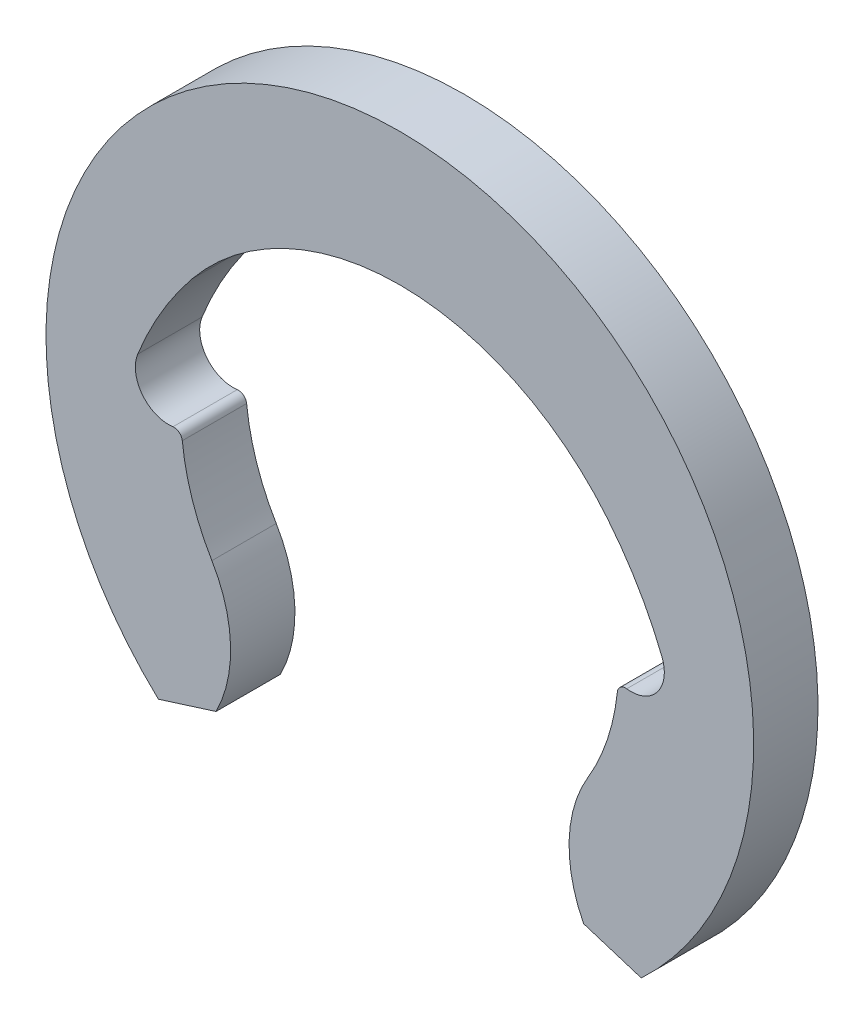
ISO-10303-21;
HEADER;
FILE_DESCRIPTION(('STEP AP214'),'2;1');
FILE_NAME('part.step','',(''),(''),'','','');
FILE_SCHEMA(('AUTOMOTIVE_DESIGN { 1 0 10303 214 1 1 1 1 }'));
ENDSEC;
DATA;
#1=APPLICATION_CONTEXT('core data for automotive mechanical design processes');
#2=APPLICATION_PROTOCOL_DEFINITION('international standard','automotive_design',2000,#1);
#3=PRODUCT_CONTEXT('',#1,'mechanical');
#4=PRODUCT('Part','Part','',(#3));
#5=PRODUCT_RELATED_PRODUCT_CATEGORY('part','',(#4));
#6=PRODUCT_DEFINITION_FORMATION('','',#4);
#7=PRODUCT_DEFINITION_CONTEXT('part definition',#1,'design');
#8=PRODUCT_DEFINITION('design','',#6,#7);
#9=PRODUCT_DEFINITION_SHAPE('','',#8);
#10=(LENGTH_UNIT() NAMED_UNIT(*) SI_UNIT(.MILLI.,.METRE.));
#11=(NAMED_UNIT(*) PLANE_ANGLE_UNIT() SI_UNIT($,.RADIAN.));
#12=(NAMED_UNIT(*) SI_UNIT($,.STERADIAN.) SOLID_ANGLE_UNIT());
#13=UNCERTAINTY_MEASURE_WITH_UNIT(LENGTH_MEASURE(1.E-05),#10,'distance_accuracy_value','');
#14=(GEOMETRIC_REPRESENTATION_CONTEXT(3) GLOBAL_UNCERTAINTY_ASSIGNED_CONTEXT((#13)) GLOBAL_UNIT_ASSIGNED_CONTEXT((#10,
#11,#12)) REPRESENTATION_CONTEXT('',''));
#15=CARTESIAN_POINT('',(0.,0.,0.));
#16=DIRECTION('',(0.,0.,1.));
#17=DIRECTION('',(1.,0.,0.));
#18=AXIS2_PLACEMENT_3D('',#15,#16,#17);
#19=CARTESIAN_POINT('',(-1.33726622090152,-0.140363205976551,0.1905));
#20=DIRECTION('',(0.,0.,-1.));
#21=DIRECTION('',(-1.,0.,0.));
#22=AXIS2_PLACEMENT_3D('',#19,#20,#21);
#23=CYLINDRICAL_SURFACE('',#22,0.0492125);
#24=CARTESIAN_POINT('',(-1.33726622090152,-0.140363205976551,-0.1905));
#25=DIRECTION('',(0.,0.,1.));
#26=DIRECTION('',(1.,0.,0.));
#27=AXIS2_PLACEMENT_3D('',#24,#25,#26);
#28=CIRCLE('',#27,0.0492125);
#29=CARTESIAN_POINT('',(-1.28832259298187,-0.135225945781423,-0.1905));
#30=VERTEX_POINT('',#29);
#31=CARTESIAN_POINT('',(-1.34373454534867,-0.0915776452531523,-0.1905));
#32=VERTEX_POINT('',#31);
#33=EDGE_CURVE('E165',#30,#32,#28,.T.);
#34=ORIENTED_EDGE('',*,*,#33,.T.);
#35=DIRECTION('',(0.,0.,-1.));
#36=VECTOR('',#35,1.);
#37=CARTESIAN_POINT('',(-1.34373454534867,-0.0915776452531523,0.1905));
#38=LINE('',#37,#36);
#39=CARTESIAN_POINT('',(-1.34373454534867,-0.0915776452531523,0.1905));
#40=VERTEX_POINT('',#39);
#41=EDGE_CURVE('E11',#40,#32,#38,.T.);
#42=ORIENTED_EDGE('',*,*,#41,.F.);
#43=CARTESIAN_POINT('',(-1.33726622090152,-0.140363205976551,0.1905));
#44=DIRECTION('',(0.,0.,1.));
#45=DIRECTION('',(1.,0.,0.));
#46=AXIS2_PLACEMENT_3D('',#43,#44,#45);
#47=CIRCLE('',#46,0.0492125);
#48=CARTESIAN_POINT('',(-1.28832259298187,-0.135225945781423,0.1905));
#49=VERTEX_POINT('',#48);
#50=EDGE_CURVE('E191',#49,#40,#47,.T.);
#51=ORIENTED_EDGE('',*,*,#50,.F.);
#52=DIRECTION('',(0.,0.,-1.));
#53=VECTOR('',#52,1.);
#54=CARTESIAN_POINT('',(-1.28832259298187,-0.135225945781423,0.1905));
#55=LINE('',#54,#53);
#56=EDGE_CURVE('E161',#49,#30,#55,.T.);
#57=ORIENTED_EDGE('',*,*,#56,.T.);
#58=EDGE_LOOP('',(#34,#42,#51,#57));
#59=FACE_BOUND('',#58,.T.);
#60=ADVANCED_FACE('F33',(#59),#23,.T.);
#61=CARTESIAN_POINT('',(-1.36960784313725,0.103564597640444,0.1905));
#62=DIRECTION('',(0.,0.,-1.));
#63=DIRECTION('',(-1.,0.,0.));
#64=AXIS2_PLACEMENT_3D('',#61,#62,#63);
#65=CYLINDRICAL_SURFACE('',#64,0.19685);
#66=CARTESIAN_POINT('',(-1.36960784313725,0.103564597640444,-0.1905));
#67=DIRECTION('',(0.,0.,-1.));
#68=DIRECTION('',(1.,0.,0.));
#69=AXIS2_PLACEMENT_3D('',#66,#67,#68);
#70=CIRCLE('',#69,0.19685);
#71=CARTESIAN_POINT('',(-1.55242571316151,0.17655465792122,-0.1905));
#72=VERTEX_POINT('',#71);
#73=EDGE_CURVE('E168',#32,#72,#70,.T.);
#74=ORIENTED_EDGE('',*,*,#73,.T.);
#75=DIRECTION('',(0.,0.,-1.));
#76=VECTOR('',#75,1.);
#77=CARTESIAN_POINT('',(-1.55242571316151,0.17655465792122,0.1905));
#78=LINE('',#77,#76);
#79=CARTESIAN_POINT('',(-1.55242571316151,0.17655465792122,0.1905));
#80=VERTEX_POINT('',#79);
#81=EDGE_CURVE('E41',#80,#72,#78,.T.);
#82=ORIENTED_EDGE('',*,*,#81,.F.);
#83=CARTESIAN_POINT('',(-1.36960784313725,0.103564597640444,0.1905));
#84=DIRECTION('',(0.,0.,-1.));
#85=DIRECTION('',(1.,0.,0.));
#86=AXIS2_PLACEMENT_3D('',#83,#84,#85);
#87=CIRCLE('',#86,0.19685);
#88=EDGE_CURVE('E110',#40,#80,#87,.T.);
#89=ORIENTED_EDGE('',*,*,#88,.F.);
#90=ORIENTED_EDGE('',*,*,#41,.T.);
#91=EDGE_LOOP('',(#74,#82,#89,#90));
#92=FACE_BOUND('',#91,.T.);
#93=ADVANCED_FACE('F279',(#92),#65,.F.);
#94=CARTESIAN_POINT('',(0.393700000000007,-0.600436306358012,0.1905));
#95=DIRECTION('',(0.,0.,-1.));
#96=DIRECTION('',(-1.,0.,0.));
#97=AXIS2_PLACEMENT_3D('',#94,#95,#96);
#98=CYLINDRICAL_SURFACE('',#97,2.0955);
#99=CARTESIAN_POINT('',(0.393700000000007,-0.600436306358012,-0.1905));
#100=DIRECTION('',(0.,0.,-1.));
#101=DIRECTION('',(-1.,0.,0.));
#102=AXIS2_PLACEMENT_3D('',#99,#100,#101);
#103=CIRCLE('',#102,2.0955);
#104=CARTESIAN_POINT('',(-1.23031250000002,0.723838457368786,-0.1905));
#105=VERTEX_POINT('',#104);
#106=EDGE_CURVE('E170',#72,#105,#103,.T.);
#107=ORIENTED_EDGE('',*,*,#106,.T.);
#108=DIRECTION('',(0.,0.,-1.));
#109=VECTOR('',#108,1.);
#110=CARTESIAN_POINT('',(-1.23031250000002,0.723838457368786,0.1905));
#111=LINE('',#110,#109);
#112=CARTESIAN_POINT('',(-1.23031250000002,0.723838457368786,0.1905));
#113=VERTEX_POINT('',#112);
#114=EDGE_CURVE('E216',#113,#105,#111,.T.);
#115=ORIENTED_EDGE('',*,*,#114,.F.);
#116=CARTESIAN_POINT('',(0.393700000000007,-0.600436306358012,0.1905));
#117=DIRECTION('',(0.,0.,-1.));
#118=DIRECTION('',(-1.,0.,0.));
#119=AXIS2_PLACEMENT_3D('',#116,#117,#118);
#120=CIRCLE('',#119,2.0955);
#121=EDGE_CURVE('E224',#80,#113,#120,.T.);
#122=ORIENTED_EDGE('',*,*,#121,.F.);
#123=ORIENTED_EDGE('',*,*,#81,.T.);
#124=EDGE_LOOP('',(#107,#115,#122,#123));
#125=FACE_BOUND('',#124,.T.);
#126=ADVANCED_FACE('F222',(#125),#98,.F.);
#127=CARTESIAN_POINT('',(0.,-0.2794,0.1905));
#128=DIRECTION('',(0.,0.,-1.));
#129=DIRECTION('',(-1.,0.,0.));
#130=AXIS2_PLACEMENT_3D('',#127,#128,#129);
#131=CYLINDRICAL_SURFACE('',#130,1.5875);
#132=CARTESIAN_POINT('',(0.,-0.2794,-0.1905));
#133=DIRECTION('',(0.,0.,-1.));
#134=DIRECTION('',(1.,0.,0.));
#135=AXIS2_PLACEMENT_3D('',#132,#133,#134);
#136=CIRCLE('',#135,1.5875);
#137=CARTESIAN_POINT('',(1.23031250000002,0.723838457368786,-0.1905));
#138=VERTEX_POINT('',#137);
#139=EDGE_CURVE('E172',#105,#138,#136,.T.);
#140=ORIENTED_EDGE('',*,*,#139,.T.);
#141=DIRECTION('',(0.,0.,-1.));
#142=VECTOR('',#141,1.);
#143=CARTESIAN_POINT('',(1.23031250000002,0.723838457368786,0.1905));
#144=LINE('',#143,#142);
#145=CARTESIAN_POINT('',(1.23031250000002,0.723838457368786,0.1905));
#146=VERTEX_POINT('',#145);
#147=EDGE_CURVE('E213',#146,#138,#144,.T.);
#148=ORIENTED_EDGE('',*,*,#147,.F.);
#149=CARTESIAN_POINT('',(0.,-0.2794,0.1905));
#150=DIRECTION('',(0.,0.,-1.));
#151=DIRECTION('',(1.,0.,0.));
#152=AXIS2_PLACEMENT_3D('',#149,#150,#151);
#153=CIRCLE('',#152,1.5875);
#154=EDGE_CURVE('E242',#113,#146,#153,.T.);
#155=ORIENTED_EDGE('',*,*,#154,.F.);
#156=ORIENTED_EDGE('',*,*,#114,.T.);
#157=EDGE_LOOP('',(#140,#148,#155,#156));
#158=FACE_BOUND('',#157,.T.);
#159=ADVANCED_FACE('F233',(#158),#131,.F.);
#160=CARTESIAN_POINT('',(-0.393699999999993,-0.600436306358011,0.1905));
#161=DIRECTION('',(0.,0.,-1.));
#162=DIRECTION('',(-1.,0.,0.));
#163=AXIS2_PLACEMENT_3D('',#160,#161,#162);
#164=CYLINDRICAL_SURFACE('',#163,2.09549999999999);
#165=CARTESIAN_POINT('',(-0.393699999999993,-0.600436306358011,-0.1905));
#166=DIRECTION('',(0.,0.,-1.));
#167=DIRECTION('',(1.,0.,0.));
#168=AXIS2_PLACEMENT_3D('',#165,#166,#167);
#169=CIRCLE('',#168,2.09549999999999);
#170=CARTESIAN_POINT('',(1.55242571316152,0.176554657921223,-0.1905));
#171=VERTEX_POINT('',#170);
#172=EDGE_CURVE('E174',#138,#171,#169,.T.);
#173=ORIENTED_EDGE('',*,*,#172,.T.);
#174=DIRECTION('',(0.,0.,-1.));
#175=VECTOR('',#174,1.);
#176=CARTESIAN_POINT('',(1.55242571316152,0.176554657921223,0.1905));
#177=LINE('',#176,#175);
#178=CARTESIAN_POINT('',(1.55242571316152,0.176554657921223,0.1905));
#179=VERTEX_POINT('',#178);
#180=EDGE_CURVE('E210',#179,#171,#177,.T.);
#181=ORIENTED_EDGE('',*,*,#180,.F.);
#182=CARTESIAN_POINT('',(-0.393699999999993,-0.600436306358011,0.1905));
#183=DIRECTION('',(0.,0.,-1.));
#184=DIRECTION('',(1.,0.,0.));
#185=AXIS2_PLACEMENT_3D('',#182,#183,#184);
#186=CIRCLE('',#185,2.09549999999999);
#187=EDGE_CURVE('E239',#146,#179,#186,.T.);
#188=ORIENTED_EDGE('',*,*,#187,.F.);
#189=ORIENTED_EDGE('',*,*,#147,.T.);
#190=EDGE_LOOP('',(#173,#181,#188,#189));
#191=FACE_BOUND('',#190,.T.);
#192=ADVANCED_FACE('F237',(#191),#164,.F.);
#193=CARTESIAN_POINT('',(1.36960784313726,0.103564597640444,0.1905));
#194=DIRECTION('',(0.,0.,-1.));
#195=DIRECTION('',(-1.,0.,0.));
#196=AXIS2_PLACEMENT_3D('',#193,#194,#195);
#197=CYLINDRICAL_SURFACE('',#196,0.196849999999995);
#198=CARTESIAN_POINT('',(1.36960784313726,0.103564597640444,-0.1905));
#199=DIRECTION('',(0.,0.,-1.));
#200=DIRECTION('',(-1.,0.,0.));
#201=AXIS2_PLACEMENT_3D('',#198,#199,#200);
#202=CIRCLE('',#201,0.196849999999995);
#203=CARTESIAN_POINT('',(1.34373454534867,-0.0915776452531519,-0.1905));
#204=VERTEX_POINT('',#203);
#205=EDGE_CURVE('E176',#171,#204,#202,.T.);
#206=ORIENTED_EDGE('',*,*,#205,.T.);
#207=DIRECTION('',(0.,0.,-1.));
#208=VECTOR('',#207,1.);
#209=CARTESIAN_POINT('',(1.34373454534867,-0.0915776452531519,0.1905));
#210=LINE('',#209,#208);
#211=CARTESIAN_POINT('',(1.34373454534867,-0.0915776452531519,0.1905));
#212=VERTEX_POINT('',#211);
#213=EDGE_CURVE('E207',#212,#204,#210,.T.);
#214=ORIENTED_EDGE('',*,*,#213,.F.);
#215=CARTESIAN_POINT('',(1.36960784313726,0.103564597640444,0.1905));
#216=DIRECTION('',(0.,0.,-1.));
#217=DIRECTION('',(-1.,0.,0.));
#218=AXIS2_PLACEMENT_3D('',#215,#216,#217);
#219=CIRCLE('',#218,0.196849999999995);
#220=EDGE_CURVE('E241',#179,#212,#219,.T.);
#221=ORIENTED_EDGE('',*,*,#220,.F.);
#222=ORIENTED_EDGE('',*,*,#180,.T.);
#223=EDGE_LOOP('',(#206,#214,#221,#222));
#224=FACE_BOUND('',#223,.T.);
#225=ADVANCED_FACE('F292',(#224),#197,.F.);
#226=CARTESIAN_POINT('',(1.33726622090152,-0.140363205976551,0.1905));
#227=DIRECTION('',(0.,0.,-1.));
#228=DIRECTION('',(-1.,0.,0.));
#229=AXIS2_PLACEMENT_3D('',#226,#227,#228);
#230=CYLINDRICAL_SURFACE('',#229,0.0492125);
#231=CARTESIAN_POINT('',(1.33726622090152,-0.140363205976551,-0.1905));
#232=DIRECTION('',(0.,0.,1.));
#233=DIRECTION('',(-1.,0.,0.));
#234=AXIS2_PLACEMENT_3D('',#231,#232,#233);
#235=CIRCLE('',#234,0.0492125);
#236=CARTESIAN_POINT('',(1.28832259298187,-0.135225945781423,-0.1905));
#237=VERTEX_POINT('',#236);
#238=EDGE_CURVE('E178',#204,#237,#235,.T.);
#239=ORIENTED_EDGE('',*,*,#238,.T.);
#240=DIRECTION('',(0.,0.,-1.));
#241=VECTOR('',#240,1.);
#242=CARTESIAN_POINT('',(1.28832259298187,-0.135225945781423,0.1905));
#243=LINE('',#242,#241);
#244=CARTESIAN_POINT('',(1.28832259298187,-0.135225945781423,0.1905));
#245=VERTEX_POINT('',#244);
#246=EDGE_CURVE('E204',#245,#237,#243,.T.);
#247=ORIENTED_EDGE('',*,*,#246,.F.);
#248=CARTESIAN_POINT('',(1.33726622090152,-0.140363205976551,0.1905));
#249=DIRECTION('',(0.,0.,1.));
#250=DIRECTION('',(-1.,0.,0.));
#251=AXIS2_PLACEMENT_3D('',#248,#249,#250);
#252=CIRCLE('',#251,0.0492125);
#253=EDGE_CURVE('E244',#212,#245,#252,.T.);
#254=ORIENTED_EDGE('',*,*,#253,.F.);
#255=ORIENTED_EDGE('',*,*,#213,.T.);
#256=EDGE_LOOP('',(#239,#247,#254,#255));
#257=FACE_BOUND('',#256,.T.);
#258=ADVANCED_FACE('F295',(#257),#230,.T.);
#259=CARTESIAN_POINT('',(0.,0.,0.1905));
#260=DIRECTION('',(0.,0.,-1.));
#261=DIRECTION('',(-1.,0.,0.));
#262=AXIS2_PLACEMENT_3D('',#259,#260,#261);
#263=CYLINDRICAL_SURFACE('',#262,1.2954);
#264=CARTESIAN_POINT('',(0.,0.,-0.1905));
#265=DIRECTION('',(0.,0.,-1.));
#266=DIRECTION('',(1.,0.,0.));
#267=AXIS2_PLACEMENT_3D('',#264,#265,#266);
#268=CIRCLE('',#267,1.2954);
#269=CARTESIAN_POINT('',(1.11300997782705,-0.662774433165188,-0.1905));
#270=VERTEX_POINT('',#269);
#271=EDGE_CURVE('E180',#237,#270,#268,.T.);
#272=ORIENTED_EDGE('',*,*,#271,.T.);
#273=DIRECTION('',(0.,0.,-1.));
#274=VECTOR('',#273,1.);
#275=CARTESIAN_POINT('',(1.11300997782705,-0.662774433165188,0.1905));
#276=LINE('',#275,#274);
#277=CARTESIAN_POINT('',(1.11300997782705,-0.662774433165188,0.1905));
#278=VERTEX_POINT('',#277);
#279=EDGE_CURVE('E201',#278,#270,#276,.T.);
#280=ORIENTED_EDGE('',*,*,#279,.F.);
#281=CARTESIAN_POINT('',(0.,0.,0.1905));
#282=DIRECTION('',(0.,0.,-1.));
#283=DIRECTION('',(1.,0.,0.));
#284=AXIS2_PLACEMENT_3D('',#281,#282,#283);
#285=CIRCLE('',#284,1.2954);
#286=EDGE_CURVE('E250',#245,#278,#285,.T.);
#287=ORIENTED_EDGE('',*,*,#286,.F.);
#288=ORIENTED_EDGE('',*,*,#246,.T.);
#289=EDGE_LOOP('',(#272,#280,#287,#288));
#290=FACE_BOUND('',#289,.T.);
#291=ADVANCED_FACE('F299',(#290),#263,.F.);
#292=CARTESIAN_POINT('',(1.78954545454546,-1.06563732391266,0.1905));
#293=DIRECTION('',(0.,0.,-1.));
#294=DIRECTION('',(-1.,0.,0.));
#295=AXIS2_PLACEMENT_3D('',#292,#293,#294);
#296=CYLINDRICAL_SURFACE('',#295,0.787400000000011);
#297=CARTESIAN_POINT('',(1.78954545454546,-1.06563732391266,-0.1905));
#298=DIRECTION('',(0.,0.,1.));
#299=DIRECTION('',(1.,0.,0.));
#300=AXIS2_PLACEMENT_3D('',#297,#298,#299);
#301=CIRCLE('',#300,0.787400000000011);
#302=CARTESIAN_POINT('',(1.08853607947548,-1.42422429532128,-0.1905));
#303=VERTEX_POINT('',#302);
#304=EDGE_CURVE('E182',#270,#303,#301,.T.);
#305=ORIENTED_EDGE('',*,*,#304,.T.);
#306=DIRECTION('',(0.,0.,-1.));
#307=VECTOR('',#306,1.);
#308=CARTESIAN_POINT('',(1.08853607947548,-1.42422429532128,0.1905));
#309=LINE('',#308,#307);
#310=CARTESIAN_POINT('',(1.08853607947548,-1.42422429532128,0.1905));
#311=VERTEX_POINT('',#310);
#312=EDGE_CURVE('E198',#311,#303,#309,.T.);
#313=ORIENTED_EDGE('',*,*,#312,.F.);
#314=CARTESIAN_POINT('',(1.78954545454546,-1.06563732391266,0.1905));
#315=DIRECTION('',(0.,0.,1.));
#316=DIRECTION('',(1.,0.,0.));
#317=AXIS2_PLACEMENT_3D('',#314,#315,#316);
#318=CIRCLE('',#317,0.787400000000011);
#319=EDGE_CURVE('E252',#278,#311,#318,.T.);
#320=ORIENTED_EDGE('',*,*,#319,.F.);
#321=ORIENTED_EDGE('',*,*,#279,.T.);
#322=EDGE_LOOP('',(#305,#313,#320,#321));
#323=FACE_BOUND('',#322,.T.);
#324=ADVANCED_FACE('F303',(#323),#296,.T.);
#325=CARTESIAN_POINT('',(1.08853607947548,-1.42422429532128,0.1905));
#326=DIRECTION('',(0.30070579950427,0.953716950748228,0.));
#327=DIRECTION('',(-0.953716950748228,0.30070579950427,0.));
#328=AXIS2_PLACEMENT_3D('',#325,#326,#327);
#329=PLANE('',#328);
#330=DIRECTION('',(0.953716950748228,-0.30070579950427,0.));
#331=VECTOR('',#330,1.);
#332=CARTESIAN_POINT('',(1.08853607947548,-1.42422429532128,-0.1905));
#333=LINE('',#332,#331);
#334=CARTESIAN_POINT('',(1.42988004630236,-1.53184963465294,-0.1905));
#335=VERTEX_POINT('',#334);
#336=EDGE_CURVE('E184',#303,#335,#333,.T.);
#337=ORIENTED_EDGE('',*,*,#336,.T.);
#338=DIRECTION('',(0.,0.,-1.));
#339=VECTOR('',#338,1.);
#340=CARTESIAN_POINT('',(1.42988004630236,-1.53184963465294,0.1905));
#341=LINE('',#340,#339);
#342=CARTESIAN_POINT('',(1.42988004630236,-1.53184963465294,0.1905));
#343=VERTEX_POINT('',#342);
#344=EDGE_CURVE('E195',#343,#335,#341,.T.);
#345=ORIENTED_EDGE('',*,*,#344,.F.);
#346=DIRECTION('',(0.953716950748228,-0.30070579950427,0.));
#347=VECTOR('',#346,1.);
#348=CARTESIAN_POINT('',(1.08853607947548,-1.42422429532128,0.1905));
#349=LINE('',#348,#347);
#350=EDGE_CURVE('E254',#311,#343,#349,.T.);
#351=ORIENTED_EDGE('',*,*,#350,.F.);
#352=ORIENTED_EDGE('',*,*,#312,.T.);
#353=EDGE_LOOP('',(#337,#345,#351,#352));
#354=FACE_BOUND('',#353,.T.);
#355=ADVANCED_FACE('F260',(#354),#329,.F.);
#356=CARTESIAN_POINT('',(0.,0.,0.1905));
#357=DIRECTION('',(0.,0.,-1.));
#358=DIRECTION('',(-1.,0.,0.));
#359=AXIS2_PLACEMENT_3D('',#356,#357,#358);
#360=CYLINDRICAL_SURFACE('',#359,2.0955);
#361=CARTESIAN_POINT('',(0.,0.,-0.1905));
#362=DIRECTION('',(0.,0.,1.));
#363=DIRECTION('',(1.,0.,0.));
#364=AXIS2_PLACEMENT_3D('',#361,#362,#363);
#365=CIRCLE('',#364,2.0955);
#366=CARTESIAN_POINT('',(-1.42988004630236,-1.53184963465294,-0.1905));
#367=VERTEX_POINT('',#366);
#368=EDGE_CURVE('E186',#335,#367,#365,.T.);
#369=ORIENTED_EDGE('',*,*,#368,.T.);
#370=DIRECTION('',(0.,0.,-1.));
#371=VECTOR('',#370,1.);
#372=CARTESIAN_POINT('',(-1.42988004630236,-1.53184963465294,0.1905));
#373=LINE('',#372,#371);
#374=CARTESIAN_POINT('',(-1.42988004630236,-1.53184963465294,0.1905));
#375=VERTEX_POINT('',#374);
#376=EDGE_CURVE('E156',#375,#367,#373,.T.);
#377=ORIENTED_EDGE('',*,*,#376,.F.);
#378=CARTESIAN_POINT('',(0.,0.,0.1905));
#379=DIRECTION('',(0.,0.,1.));
#380=DIRECTION('',(1.,0.,0.));
#381=AXIS2_PLACEMENT_3D('',#378,#379,#380);
#382=CIRCLE('',#381,2.0955);
#383=EDGE_CURVE('E147',#343,#375,#382,.T.);
#384=ORIENTED_EDGE('',*,*,#383,.F.);
#385=ORIENTED_EDGE('',*,*,#344,.T.);
#386=EDGE_LOOP('',(#369,#377,#384,#385));
#387=FACE_BOUND('',#386,.T.);
#388=ADVANCED_FACE('F264',(#387),#360,.T.);
#389=CARTESIAN_POINT('',(-1.08853607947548,-1.42422429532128,0.1905));
#390=DIRECTION('',(-0.30070579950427,0.953716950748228,0.));
#391=DIRECTION('',(-0.953716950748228,-0.30070579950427,0.));
#392=AXIS2_PLACEMENT_3D('',#389,#390,#391);
#393=PLANE('',#392);
#394=DIRECTION('',(0.953716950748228,0.30070579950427,0.));
#395=VECTOR('',#394,1.);
#396=CARTESIAN_POINT('',(-1.08853607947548,-1.42422429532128,-0.1905));
#397=LINE('',#396,#395);
#398=CARTESIAN_POINT('',(-1.08853607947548,-1.42422429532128,-0.1905));
#399=VERTEX_POINT('',#398);
#400=EDGE_CURVE('E155',#367,#399,#397,.T.);
#401=ORIENTED_EDGE('',*,*,#400,.T.);
#402=DIRECTION('',(0.,0.,-1.));
#403=VECTOR('',#402,1.);
#404=CARTESIAN_POINT('',(-1.08853607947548,-1.42422429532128,0.1905));
#405=LINE('',#404,#403);
#406=CARTESIAN_POINT('',(-1.08853607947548,-1.42422429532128,0.1905));
#407=VERTEX_POINT('',#406);
#408=EDGE_CURVE('E152',#407,#399,#405,.T.);
#409=ORIENTED_EDGE('',*,*,#408,.F.);
#410=DIRECTION('',(0.953716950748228,0.30070579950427,0.));
#411=VECTOR('',#410,1.);
#412=CARTESIAN_POINT('',(-1.08853607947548,-1.42422429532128,0.1905));
#413=LINE('',#412,#411);
#414=EDGE_CURVE('E141',#375,#407,#413,.T.);
#415=ORIENTED_EDGE('',*,*,#414,.F.);
#416=ORIENTED_EDGE('',*,*,#376,.T.);
#417=EDGE_LOOP('',(#401,#409,#415,#416));
#418=FACE_BOUND('',#417,.T.);
#419=ADVANCED_FACE('F153',(#418),#393,.F.);
#420=CARTESIAN_POINT('',(-1.78954545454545,-1.06563732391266,0.1905));
#421=DIRECTION('',(0.,0.,-1.));
#422=DIRECTION('',(-1.,0.,0.));
#423=AXIS2_PLACEMENT_3D('',#420,#421,#422);
#424=CYLINDRICAL_SURFACE('',#423,0.7874);
#425=CARTESIAN_POINT('',(-1.78954545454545,-1.06563732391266,-0.1905));
#426=DIRECTION('',(0.,0.,1.));
#427=DIRECTION('',(-1.,0.,0.));
#428=AXIS2_PLACEMENT_3D('',#425,#426,#427);
#429=CIRCLE('',#428,0.7874);
#430=CARTESIAN_POINT('',(-1.11300997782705,-0.662774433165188,-0.1905));
#431=VERTEX_POINT('',#430);
#432=EDGE_CURVE('E96',#399,#431,#429,.T.);
#433=ORIENTED_EDGE('',*,*,#432,.T.);
#434=DIRECTION('',(0.,0.,-1.));
#435=VECTOR('',#434,1.);
#436=CARTESIAN_POINT('',(-1.11300997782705,-0.662774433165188,0.1905));
#437=LINE('',#436,#435);
#438=CARTESIAN_POINT('',(-1.11300997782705,-0.662774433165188,0.1905));
#439=VERTEX_POINT('',#438);
#440=EDGE_CURVE('E157',#439,#431,#437,.T.);
#441=ORIENTED_EDGE('',*,*,#440,.F.);
#442=CARTESIAN_POINT('',(-1.78954545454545,-1.06563732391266,0.1905));
#443=DIRECTION('',(0.,0.,1.));
#444=DIRECTION('',(-1.,0.,0.));
#445=AXIS2_PLACEMENT_3D('',#442,#443,#444);
#446=CIRCLE('',#445,0.7874);
#447=EDGE_CURVE('E145',#407,#439,#446,.T.);
#448=ORIENTED_EDGE('',*,*,#447,.F.);
#449=ORIENTED_EDGE('',*,*,#408,.T.);
#450=EDGE_LOOP('',(#433,#441,#448,#449));
#451=FACE_BOUND('',#450,.T.);
#452=ADVANCED_FACE('F159',(#451),#424,.T.);
#453=CARTESIAN_POINT('',(0.,0.,0.1905));
#454=DIRECTION('',(0.,0.,-1.));
#455=DIRECTION('',(-1.,0.,0.));
#456=AXIS2_PLACEMENT_3D('',#453,#454,#455);
#457=CYLINDRICAL_SURFACE('',#456,1.2954);
#458=CARTESIAN_POINT('',(0.,0.,-0.1905));
#459=DIRECTION('',(0.,0.,-1.));
#460=DIRECTION('',(1.,0.,0.));
#461=AXIS2_PLACEMENT_3D('',#458,#459,#460);
#462=CIRCLE('',#461,1.2954);
#463=EDGE_CURVE('E102',#431,#30,#462,.T.);
#464=ORIENTED_EDGE('',*,*,#463,.T.);
#465=ORIENTED_EDGE('',*,*,#56,.F.);
#466=CARTESIAN_POINT('',(0.,0.,0.1905));
#467=DIRECTION('',(0.,0.,-1.));
#468=DIRECTION('',(1.,0.,0.));
#469=AXIS2_PLACEMENT_3D('',#466,#467,#468);
#470=CIRCLE('',#469,1.2954);
#471=EDGE_CURVE('E49',#439,#49,#470,.T.);
#472=ORIENTED_EDGE('',*,*,#471,.F.);
#473=ORIENTED_EDGE('',*,*,#440,.T.);
#474=EDGE_LOOP('',(#464,#465,#472,#473));
#475=FACE_BOUND('',#474,.T.);
#476=ADVANCED_FACE('F268',(#475),#457,.F.);
#477=CARTESIAN_POINT('',(-1.33726622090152,-0.140363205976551,0.1905));
#478=DIRECTION('',(0.,0.,1.));
#479=DIRECTION('',(1.,0.,0.));
#480=AXIS2_PLACEMENT_3D('',#477,#478,#479);
#481=PLANE('',#480);
#482=ORIENTED_EDGE('',*,*,#50,.T.);
#483=ORIENTED_EDGE('',*,*,#88,.T.);
#484=ORIENTED_EDGE('',*,*,#121,.T.);
#485=ORIENTED_EDGE('',*,*,#154,.T.);
#486=ORIENTED_EDGE('',*,*,#187,.T.);
#487=ORIENTED_EDGE('',*,*,#220,.T.);
#488=ORIENTED_EDGE('',*,*,#253,.T.);
#489=ORIENTED_EDGE('',*,*,#286,.T.);
#490=ORIENTED_EDGE('',*,*,#319,.T.);
#491=ORIENTED_EDGE('',*,*,#350,.T.);
#492=ORIENTED_EDGE('',*,*,#383,.T.);
#493=ORIENTED_EDGE('',*,*,#414,.T.);
#494=ORIENTED_EDGE('',*,*,#447,.T.);
#495=ORIENTED_EDGE('',*,*,#471,.T.);
#496=EDGE_LOOP('',(#482,#483,#484,#485,#486,#487,#488,#489,#490,#491,#492,#493,#494,#495));
#497=FACE_BOUND('',#496,.T.);
#498=ADVANCED_FACE('F143',(#497),#481,.T.);
#499=CARTESIAN_POINT('',(-1.33726622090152,-0.140363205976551,-0.1905));
#500=DIRECTION('',(0.,0.,1.));
#501=DIRECTION('',(1.,0.,0.));
#502=AXIS2_PLACEMENT_3D('',#499,#500,#501);
#503=PLANE('',#502);
#504=ORIENTED_EDGE('',*,*,#33,.F.);
#505=ORIENTED_EDGE('',*,*,#463,.F.);
#506=ORIENTED_EDGE('',*,*,#432,.F.);
#507=ORIENTED_EDGE('',*,*,#400,.F.);
#508=ORIENTED_EDGE('',*,*,#368,.F.);
#509=ORIENTED_EDGE('',*,*,#336,.F.);
#510=ORIENTED_EDGE('',*,*,#304,.F.);
#511=ORIENTED_EDGE('',*,*,#271,.F.);
#512=ORIENTED_EDGE('',*,*,#238,.F.);
#513=ORIENTED_EDGE('',*,*,#205,.F.);
#514=ORIENTED_EDGE('',*,*,#172,.F.);
#515=ORIENTED_EDGE('',*,*,#139,.F.);
#516=ORIENTED_EDGE('',*,*,#106,.F.);
#517=ORIENTED_EDGE('',*,*,#73,.F.);
#518=EDGE_LOOP('',(#504,#505,#506,#507,#508,#509,#510,#511,#512,#513,#514,#515,#516,#517));
#519=FACE_BOUND('',#518,.T.);
#520=ADVANCED_FACE('F228',(#519),#503,.F.);
#521=CLOSED_SHELL('',(#60,#93,#126,#159,#192,#225,#258,#291,#324,#355,#388,#419,#452,#476,#498,#520));
#522=MANIFOLD_SOLID_BREP('B2',#521);
#523=ADVANCED_BREP_SHAPE_REPRESENTATION('',(#18,#522),#14);
#524=SHAPE_DEFINITION_REPRESENTATION(#9,#523);
ENDSEC;
END-ISO-10303-21;
